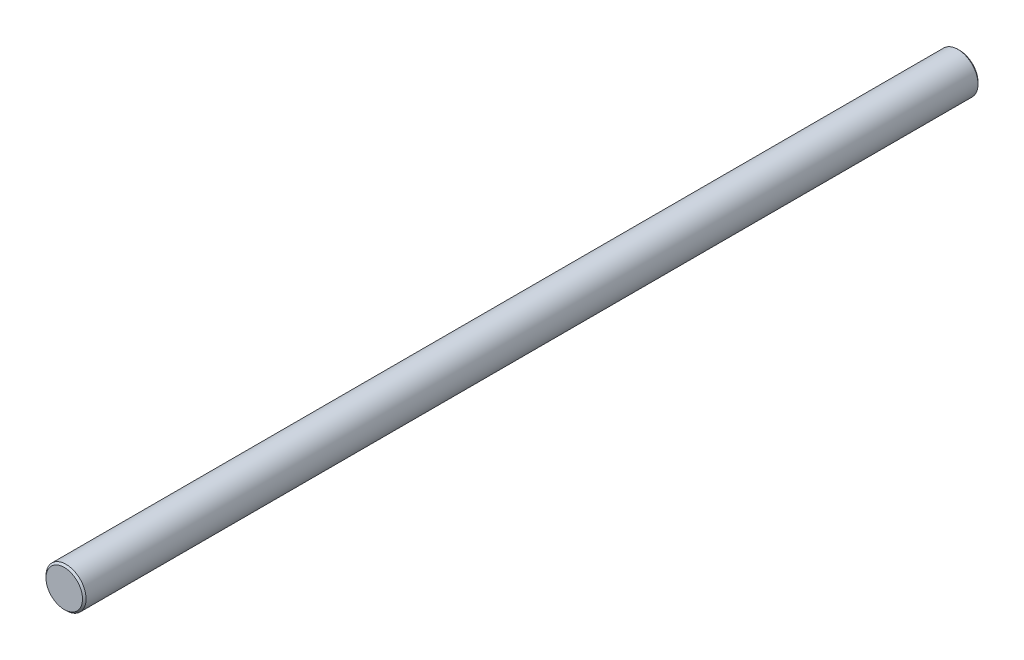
from build123d import *

# Parameters (mm, degrees)
SKETCH1_R          = 1.4224
BASE_EXTRUDE_DEPTH = 63.5
CHAMFER1_SIZE      = 0.127


with BuildPart() as part:
    # Sketch1 → Base-Extrude (new body)
    with BuildSketch(Plane.XY):
        Circle(SKETCH1_R)
    extrude(amount=BASE_EXTRUDE_DEPTH)

    # Chamfer1
    chamfer1_edges = [part.edges().sort_by_distance(p)[0] for p in [
        (-1.4224, 0, 0),
        (-1.4224, 0, 63.5),
    ]]
    chamfer(chamfer1_edges, length=CHAMFER1_SIZE)


solid = part.part
